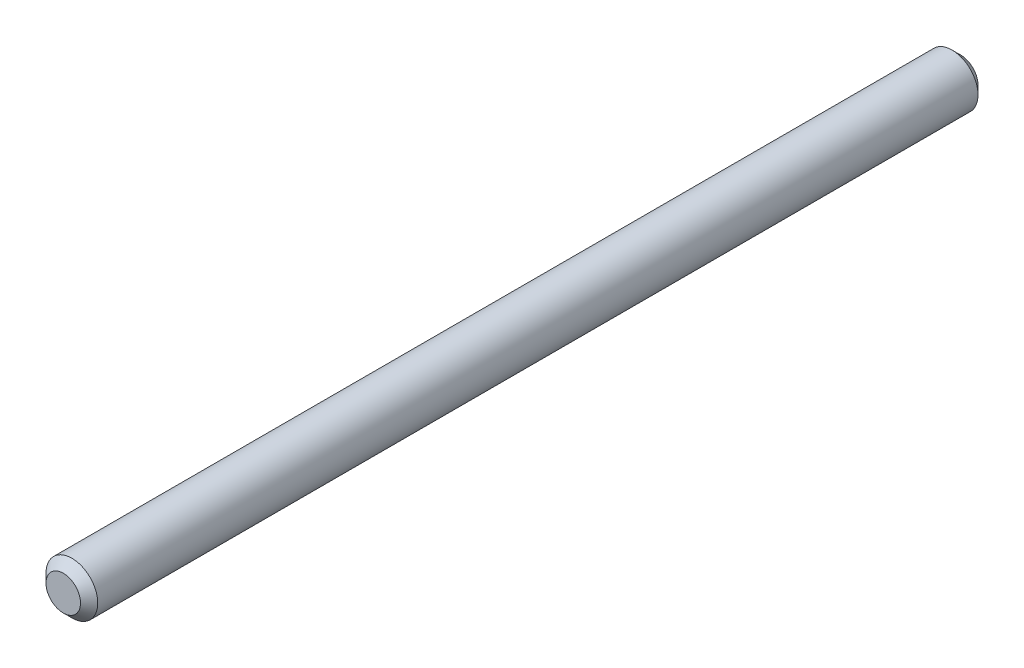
from build123d import *

# Parameters (mm, degrees)
ESQUISSE1_R          = 1.5
BASE_EXTRUSION_DEPTH = 52
CHANFREIN1_SIZE      = 0.5


with BuildPart() as part:
    # Esquisse1 → Base-Extrusion (new body)
    with BuildSketch(Plane.XY):
        with Locations(Location((0, 0, 0), (0, 0, 180))):
            Circle(ESQUISSE1_R)
    extrude(amount=BASE_EXTRUSION_DEPTH)

    # Chanfrein1
    chanfrein1_edges = [part.edges().sort_by_distance(p)[0] for p in [
        (1.5, 0, 0),
        (1.5, 0, 52),
    ]]
    chamfer(chanfrein1_edges, length=CHANFREIN1_SIZE)


solid = part.part
